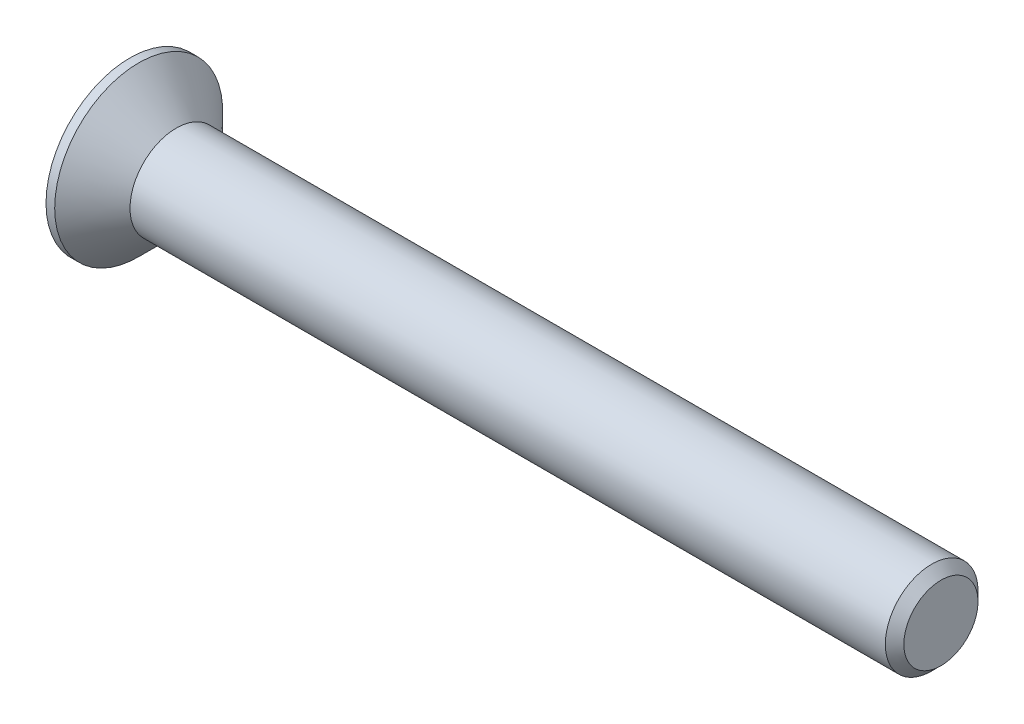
from build123d import *

# Parameters (mm, degrees)
CHAMFER1_SIZE      = 0.8
CUT_EXTRUDE1_DEPTH = 3.45


with BuildPart() as part:
    # Sketch1 → Revolve1 (revolve)
    with BuildSketch(Plane.XY, mode=Mode.PRIVATE) as revolve1_sk:
        Polygon((-4, 7.25), (-4, 0), (66, 0), (66, 4), (0, 4), (-3.25, 7.25), align=None)
    revolve(revolve1_sk.sketch.rotate(Axis((-4, 0, 0), (1, 0, 0)), 90), axis=Axis((-4, 0, 0), (1, 0, 0)))

    # Chamfer1
    chamfer1_edges = [part.edges().sort_by_distance(p)[0] for p in [
        (66, 0, -4),
    ]]
    chamfer(chamfer1_edges, length=CHAMFER1_SIZE)

    # Sketch2 → Cut-Extrude1 (cut)
    with BuildSketch(Plane.ZY.offset(4)):
        Polygon((-1.09, 4.35), (1.09, 4.35), (1.09, 1.09), (4.35, 1.09), (4.35, -1.09), (1.09, -1.09), (1.09, -4.35), (-1.09, -4.35), (-1.09, -1.09), (-4.35, -1.09), (-4.35, 1.09), (-1.09, 1.09), align=None)
    extrude(amount=-CUT_EXTRUDE1_DEPTH, mode=Mode.SUBTRACT)


solid = part.part
